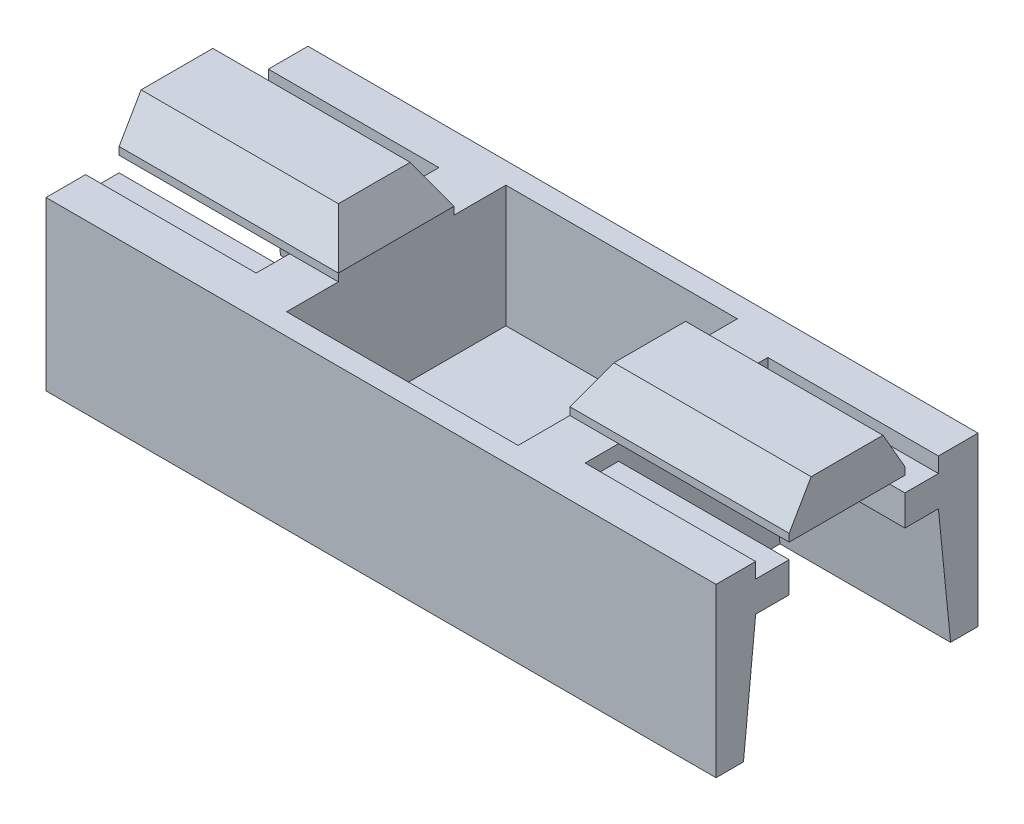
from build123d import *
from OCP.BRepFilletAPI import BRepFilletAPI_MakeChamfer

# Parameters (mm, degrees)
ESQUISSE1_W             = 22
ESQUISSE1_H             = 7
BOSS_EXTRU_1_DEPTH      = 8.6
ESQUISSE2_W             = 7.6
ESQUISSE2_H             = 7.2
ENL_V_MAT_EXTRU_1_DEPTH = 5.5
ESQUISSE3_W             = 2.4
ESQUISSE3_H             = 1.5
ENL_V_MAT_EXTRU_2_DEPTH = 25.636558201
ENL_V_MAT_EXTRU_5_DEPTH = 5.6
CHANFREIN1_SIZE         = 1.25
CHANFREIN1_SIZE2        = 0.721687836
CHANFREIN2_SIZE         = 1.25
CHANFREIN2_SIZE2        = 0.721687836


with BuildPart() as part:
    # Esquisse1 → Boss.-Extru.1 (new body)
    with BuildSketch(Plane.XY):
        with Locations((11, 3.5)):
            Rectangle(ESQUISSE1_W, ESQUISSE1_H)
    extrude(amount=BOSS_EXTRU_1_DEPTH)

    # Esquisse2 → Enl_v. mat.-Extru.1 (cut)
    with BuildSketch(Plane(origin=(0, 7, 0), x_dir=(1, 0, 0), z_dir=(0, 1, 0))):
        with Locations((11, -4.3)):
            Rectangle(ESQUISSE2_W, ESQUISSE2_H)
    extrude(amount=-ENL_V_MAT_EXTRU_1_DEPTH, mode=Mode.SUBTRACT)

    # Esquisse3 → Enl_v. mat.-Extru.2 (cut, through all)
    with BuildSketch(Plane(origin=(22, 0, 0), x_dir=(0, 0, -1), z_dir=(1, 0, 0))):
        with Locations((-1.2, 6.25)):
            Rectangle(ESQUISSE3_W, ESQUISSE3_H)
        with Locations((-7.4, 6.25)):
            Rectangle(ESQUISSE3_W, ESQUISSE3_H)
    extrude(amount=-ENL_V_MAT_EXTRU_2_DEPTH, mode=Mode.SUBTRACT)

    # Esquisse6 → Enl_v. mat.-Extru.5 (cut)
    with BuildSketch(Plane(origin=(22, 0, 0), x_dir=(0, 0, -1), z_dir=(1, 0, 0))):
        Polygon((-1.3, 5.5), (-7.3, 5.5), (-7.3, 5), (-6.2, 5), (-6.2, 4), (-7.3, 4), (-7.7, 0), (-0.9, 0), (-1.3, 4), (-2.4, 4), (-2.4, 5), (-1.3, 5), align=None)
    enl_v_mat_extru_5 = extrude(amount=-ENL_V_MAT_EXTRU_5_DEPTH, mode=Mode.SUBTRACT)

    # Chanfrein1: one chamfer whose edges measure the first distance from different faces: ONE call of the kernel's chamfer builder (chamfer() names one face for all edges)
    chanfrein1_edges_1 = [part.edges().sort_by_distance(p)[0] for p in [
        (14.8, 7, 4.3),
    ]]
    chanfrein1_side_1 = [part.faces().sort_by_distance(p)[0] for p in [
        (14.8, 3.954347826, 4.3),
    ]]
    chanfrein1_edges_2 = [part.edges().sort_by_distance(p)[0] for p in [
        (18.4, 7, 6.2),
    ]]
    chanfrein1_side_2 = [part.faces().sort_by_distance(p)[0] for p in [
        (18.4, 6.25, 6.2),
    ]]
    chanfrein1_edges_3 = [part.edges().sort_by_distance(p)[0] for p in [
        (18.4, 7, 2.4),
    ]]
    chanfrein1_side_3 = [part.faces().sort_by_distance(p)[0] for p in [
        (18.4, 6.25, 2.4),
    ]]
    chanfrein1 = BRepFilletAPI_MakeChamfer(part.part.solid().wrapped)
    for e in chanfrein1_edges_1:
        chanfrein1.Add(CHANFREIN1_SIZE, CHANFREIN1_SIZE2, e.wrapped, chanfrein1_side_1[0].wrapped)  # the first distance lies on this face
    for e in chanfrein1_edges_2:
        chanfrein1.Add(CHANFREIN1_SIZE, CHANFREIN1_SIZE2, e.wrapped, chanfrein1_side_2[0].wrapped)  # the first distance lies on this face
    for e in chanfrein1_edges_3:
        chanfrein1.Add(CHANFREIN1_SIZE, CHANFREIN1_SIZE2, e.wrapped, chanfrein1_side_3[0].wrapped)  # the first distance lies on this face
    add(Compound.cast(chanfrein1.Shape()), mode=Mode.REPLACE)

    # Sym_trie4: Enl_v. mat.-Extru.5 across plane
    add(enl_v_mat_extru_5.mirror(Plane(origin=(11, 0, 0), x_dir=(0, 0, 1), z_dir=(1, 0, 0))), mode=Mode.SUBTRACT)

    # Chanfrein2: one chamfer whose edges measure the first distance from different faces: ONE call of the kernel's chamfer builder (chamfer() names one face for all edges)
    chanfrein2_edges_1 = [part.edges().sort_by_distance(p)[0] for p in [
        (3.6, 7, 6.2),
    ]]
    chanfrein2_side_1 = [part.faces().sort_by_distance(p)[0] for p in [
        (3.6, 6.25, 6.2),
    ]]
    chanfrein2_edges_2 = [part.edges().sort_by_distance(p)[0] for p in [
        (7.2, 7, 4.3),
    ]]
    chanfrein2_side_2 = [part.faces().sort_by_distance(p)[0] for p in [
        (7.2, 3.954347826, 4.3),
    ]]
    chanfrein2_edges_3 = [part.edges().sort_by_distance(p)[0] for p in [
        (3.6, 7, 2.4),
    ]]
    chanfrein2_side_3 = [part.faces().sort_by_distance(p)[0] for p in [
        (3.6, 6.25, 2.4),
    ]]
    chanfrein2 = BRepFilletAPI_MakeChamfer(part.part.solid().wrapped)
    for e in chanfrein2_edges_1:
        chanfrein2.Add(CHANFREIN2_SIZE, CHANFREIN2_SIZE2, e.wrapped, chanfrein2_side_1[0].wrapped)  # the first distance lies on this face
    for e in chanfrein2_edges_2:
        chanfrein2.Add(CHANFREIN2_SIZE, CHANFREIN2_SIZE2, e.wrapped, chanfrein2_side_2[0].wrapped)  # the first distance lies on this face
    for e in chanfrein2_edges_3:
        chanfrein2.Add(CHANFREIN2_SIZE, CHANFREIN2_SIZE2, e.wrapped, chanfrein2_side_3[0].wrapped)  # the first distance lies on this face
    add(Compound.cast(chanfrein2.Shape()), mode=Mode.REPLACE)


solid = part.part
